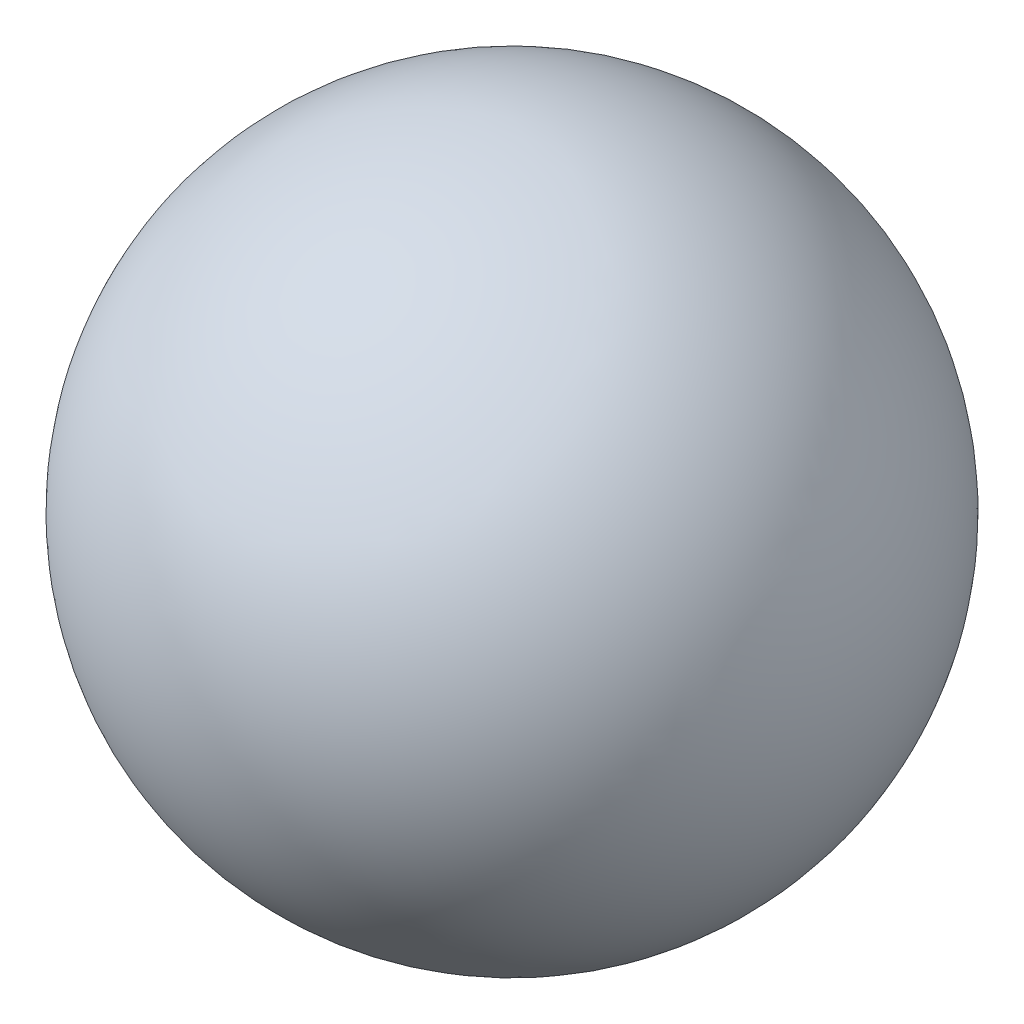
ISO-10303-21;
HEADER;
FILE_DESCRIPTION(('STEP AP214'),'2;1');
FILE_NAME('part.step','',(''),(''),'','','');
FILE_SCHEMA(('AUTOMOTIVE_DESIGN { 1 0 10303 214 1 1 1 1 }'));
ENDSEC;
DATA;
#1=APPLICATION_CONTEXT('core data for automotive mechanical design processes');
#2=APPLICATION_PROTOCOL_DEFINITION('international standard','automotive_design',2000,#1);
#3=PRODUCT_CONTEXT('',#1,'mechanical');
#4=PRODUCT('Part','Part','',(#3));
#5=PRODUCT_RELATED_PRODUCT_CATEGORY('part','',(#4));
#6=PRODUCT_DEFINITION_FORMATION('','',#4);
#7=PRODUCT_DEFINITION_CONTEXT('part definition',#1,'design');
#8=PRODUCT_DEFINITION('design','',#6,#7);
#9=PRODUCT_DEFINITION_SHAPE('','',#8);
#10=(LENGTH_UNIT() NAMED_UNIT(*) SI_UNIT(.MILLI.,.METRE.));
#11=(NAMED_UNIT(*) PLANE_ANGLE_UNIT() SI_UNIT($,.RADIAN.));
#12=(NAMED_UNIT(*) SI_UNIT($,.STERADIAN.) SOLID_ANGLE_UNIT());
#13=UNCERTAINTY_MEASURE_WITH_UNIT(LENGTH_MEASURE(1.E-05),#10,'distance_accuracy_value','');
#14=(GEOMETRIC_REPRESENTATION_CONTEXT(3) GLOBAL_UNCERTAINTY_ASSIGNED_CONTEXT((#13)) GLOBAL_UNIT_ASSIGNED_CONTEXT((#10,
#11,#12)) REPRESENTATION_CONTEXT('',''));
#15=CARTESIAN_POINT('',(0.,0.,0.));
#16=DIRECTION('',(0.,0.,1.));
#17=DIRECTION('',(1.,0.,0.));
#18=AXIS2_PLACEMENT_3D('',#15,#16,#17);
#19=CARTESIAN_POINT('',(0.,0.,0.));
#20=DIRECTION('',(-1.,0.,0.));
#21=DIRECTION('',(0.,0.,-1.));
#22=AXIS2_PLACEMENT_3D('',#19,#20,#21);
#23=SPHERICAL_SURFACE('',#22,4.76);
#24=CARTESIAN_POINT('',(-4.76,0.,0.));
#25=VERTEX_POINT('',#24);
#26=VERTEX_LOOP('',#25);
#27=FACE_BOUND('',#26,.T.);
#28=ADVANCED_FACE('F29',(#27),#23,.T.);
#29=CLOSED_SHELL('',(#28));
#30=MANIFOLD_SOLID_BREP('B2',#29);
#31=ADVANCED_BREP_SHAPE_REPRESENTATION('',(#18,#30),#14);
#32=SHAPE_DEFINITION_REPRESENTATION(#9,#31);
ENDSEC;
END-ISO-10303-21;
